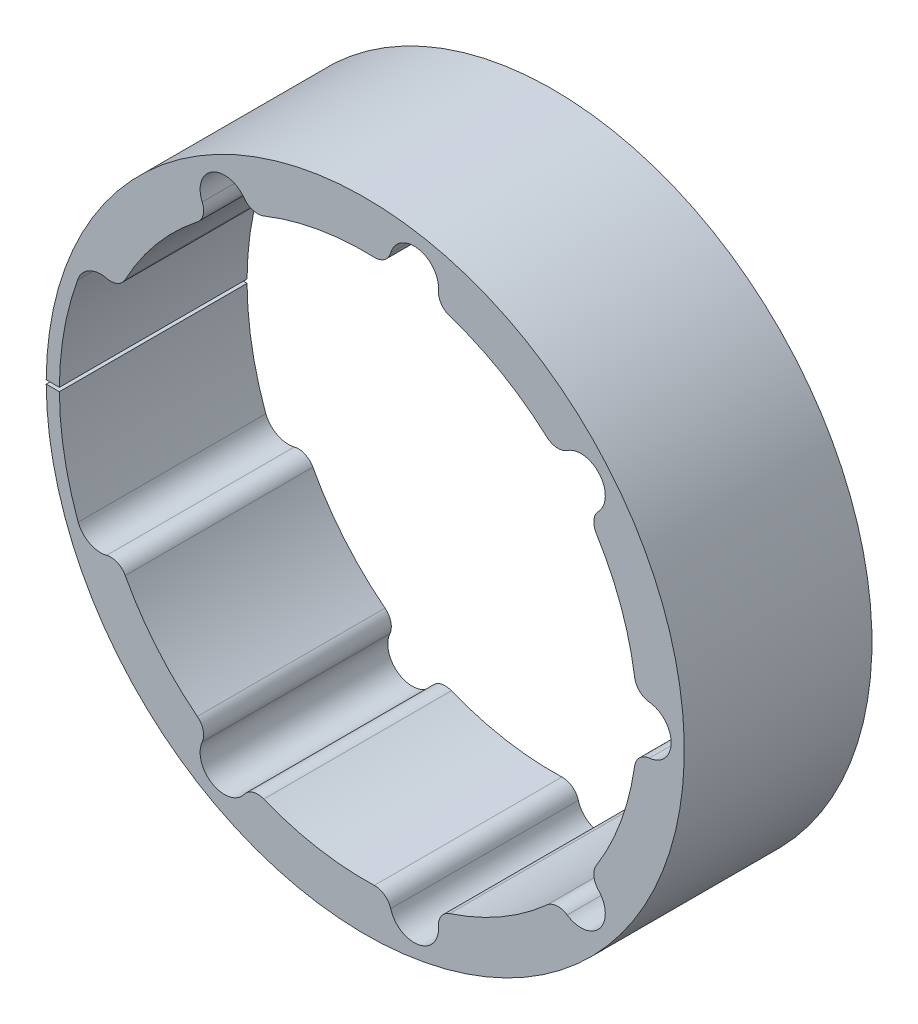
ISO-10303-21;
HEADER;
FILE_DESCRIPTION(('STEP AP214'),'2;1');
FILE_NAME('part.step','',(''),(''),'','','');
FILE_SCHEMA(('AUTOMOTIVE_DESIGN { 1 0 10303 214 1 1 1 1 }'));
ENDSEC;
DATA;
#1=APPLICATION_CONTEXT('core data for automotive mechanical design processes');
#2=APPLICATION_PROTOCOL_DEFINITION('international standard','automotive_design',2000,#1);
#3=PRODUCT_CONTEXT('',#1,'mechanical');
#4=PRODUCT('Part','Part','',(#3));
#5=PRODUCT_RELATED_PRODUCT_CATEGORY('part','',(#4));
#6=PRODUCT_DEFINITION_FORMATION('','',#4);
#7=PRODUCT_DEFINITION_CONTEXT('part definition',#1,'design');
#8=PRODUCT_DEFINITION('design','',#6,#7);
#9=PRODUCT_DEFINITION_SHAPE('','',#8);
#10=(LENGTH_UNIT() NAMED_UNIT(*) SI_UNIT(.MILLI.,.METRE.));
#11=(NAMED_UNIT(*) PLANE_ANGLE_UNIT() SI_UNIT($,.RADIAN.));
#12=(NAMED_UNIT(*) SI_UNIT($,.STERADIAN.) SOLID_ANGLE_UNIT());
#13=UNCERTAINTY_MEASURE_WITH_UNIT(LENGTH_MEASURE(1.E-05),#10,'distance_accuracy_value','');
#14=(GEOMETRIC_REPRESENTATION_CONTEXT(3) GLOBAL_UNCERTAINTY_ASSIGNED_CONTEXT((#13)) GLOBAL_UNIT_ASSIGNED_CONTEXT((#10,
#11,#12)) REPRESENTATION_CONTEXT('',''));
#15=CARTESIAN_POINT('',(0.,0.,0.));
#16=DIRECTION('',(0.,0.,1.));
#17=DIRECTION('',(1.,0.,0.));
#18=AXIS2_PLACEMENT_3D('',#15,#16,#17);
#19=CARTESIAN_POINT('',(0.,0.,25.));
#20=DIRECTION('',(0.,0.,-1.));
#21=DIRECTION('',(-1.,0.,0.));
#22=AXIS2_PLACEMENT_3D('',#19,#20,#21);
#23=CYLINDRICAL_SURFACE('',#22,40.7477238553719);
#24=CARTESIAN_POINT('',(0.,0.,0.));
#25=DIRECTION('',(0.,0.,1.));
#26=DIRECTION('',(1.,0.,0.));
#27=AXIS2_PLACEMENT_3D('',#24,#25,#26);
#28=CIRCLE('',#27,40.7477238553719);
#29=CARTESIAN_POINT('',(-38.3335079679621,13.8173501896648,0.));
#30=VERTEX_POINT('',#29);
#31=CARTESIAN_POINT('',(-40.7469569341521,0.249999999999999,0.));
#32=VERTEX_POINT('',#31);
#33=EDGE_CURVE('E300',#30,#32,#28,.T.);
#34=ORIENTED_EDGE('',*,*,#33,.F.);
#35=DIRECTION('',(0.,0.,-1.));
#36=VECTOR('',#35,1.);
#37=CARTESIAN_POINT('',(-38.3335079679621,13.8173501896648,25.));
#38=LINE('',#37,#36);
#39=CARTESIAN_POINT('',(-38.3335079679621,13.8173501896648,25.));
#40=VERTEX_POINT('',#39);
#41=EDGE_CURVE('E289',#40,#30,#38,.T.);
#42=ORIENTED_EDGE('',*,*,#41,.F.);
#43=CARTESIAN_POINT('',(0.,0.,25.));
#44=DIRECTION('',(0.,0.,1.));
#45=DIRECTION('',(1.,0.,0.));
#46=AXIS2_PLACEMENT_3D('',#43,#44,#45);
#47=CIRCLE('',#46,40.7477238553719);
#48=CARTESIAN_POINT('',(-40.7469569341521,0.249999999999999,25.));
#49=VERTEX_POINT('',#48);
#50=EDGE_CURVE('E295',#40,#49,#47,.T.);
#51=ORIENTED_EDGE('',*,*,#50,.T.);
#52=DIRECTION('',(0.,0.,-1.));
#53=VECTOR('',#52,1.);
#54=CARTESIAN_POINT('',(-40.7469569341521,0.249999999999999,25.));
#55=LINE('',#54,#53);
#56=EDGE_CURVE('E337',#49,#32,#55,.T.);
#57=ORIENTED_EDGE('',*,*,#56,.T.);
#58=EDGE_LOOP('',(#34,#42,#51,#57));
#59=FACE_BOUND('',#58,.T.);
#60=ADVANCED_FACE('F39',(#59),#23,.F.);
#61=CARTESIAN_POINT('',(-35.2384732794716,12.8257553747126,25.));
#62=DIRECTION('',(0.,0.,-1.));
#63=DIRECTION('',(-1.,0.,0.));
#64=AXIS2_PLACEMENT_3D('',#61,#62,#63);
#65=CYLINDRICAL_SURFACE('',#64,3.25000000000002);
#66=CARTESIAN_POINT('',(-35.2384732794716,12.8257553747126,0.));
#67=DIRECTION('',(0.,0.,1.));
#68=DIRECTION('',(1.,0.,0.));
#69=AXIS2_PLACEMENT_3D('',#66,#67,#68);
#70=CIRCLE('',#69,3.25000000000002);
#71=CARTESIAN_POINT('',(-34.4500862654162,15.97868193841,0.));
#72=VERTEX_POINT('',#71);
#73=EDGE_CURVE('E339',#72,#30,#70,.T.);
#74=ORIENTED_EDGE('',*,*,#73,.F.);
#75=DIRECTION('',(0.,0.,-1.));
#76=VECTOR('',#75,1.);
#77=CARTESIAN_POINT('',(-34.4500862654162,15.97868193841,25.));
#78=LINE('',#77,#76);
#79=CARTESIAN_POINT('',(-34.4500862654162,15.97868193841,25.));
#80=VERTEX_POINT('',#79);
#81=EDGE_CURVE('E11',#72,#80,#78,.F.);
#82=ORIENTED_EDGE('',*,*,#81,.T.);
#83=CARTESIAN_POINT('',(-35.2384732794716,12.8257553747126,25.));
#84=DIRECTION('',(0.,0.,1.));
#85=DIRECTION('',(1.,0.,0.));
#86=AXIS2_PLACEMENT_3D('',#83,#84,#85);
#87=CIRCLE('',#86,3.25000000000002);
#88=EDGE_CURVE('E285',#80,#40,#87,.T.);
#89=ORIENTED_EDGE('',*,*,#88,.T.);
#90=ORIENTED_EDGE('',*,*,#41,.T.);
#91=EDGE_LOOP('',(#74,#82,#89,#90));
#92=FACE_BOUND('',#91,.T.);
#93=ADVANCED_FACE('F288',(#92),#65,.F.);
#94=CARTESIAN_POINT('',(0.,0.,25.));
#95=DIRECTION('',(0.,0.,-1.));
#96=DIRECTION('',(-1.,0.,0.));
#97=AXIS2_PLACEMENT_3D('',#94,#95,#96);
#98=CYLINDRICAL_SURFACE('',#97,36.25);
#99=CARTESIAN_POINT('',(0.,0.,0.));
#100=DIRECTION('',(0.,0.,1.));
#101=DIRECTION('',(1.,0.,0.));
#102=AXIS2_PLACEMENT_3D('',#99,#100,#101);
#103=CIRCLE('',#102,36.25);
#104=CARTESIAN_POINT('',(-22.3697067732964,28.5247036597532,0.));
#105=VERTEX_POINT('',#104);
#106=CARTESIAN_POINT('',(-31.9758081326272,17.0765978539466,0.));
#107=VERTEX_POINT('',#106);
#108=EDGE_CURVE('E342',#105,#107,#103,.T.);
#109=ORIENTED_EDGE('',*,*,#108,.F.);
#110=DIRECTION('',(0.,0.,-1.));
#111=VECTOR('',#110,1.);
#112=CARTESIAN_POINT('',(-22.3697067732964,28.5247036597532,25.));
#113=LINE('',#112,#111);
#114=CARTESIAN_POINT('',(-22.3697067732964,28.5247036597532,25.));
#115=VERTEX_POINT('',#114);
#116=EDGE_CURVE('E47',#105,#115,#113,.F.);
#117=ORIENTED_EDGE('',*,*,#116,.T.);
#118=CARTESIAN_POINT('',(0.,0.,25.));
#119=DIRECTION('',(0.,0.,1.));
#120=DIRECTION('',(1.,0.,0.));
#121=AXIS2_PLACEMENT_3D('',#118,#119,#120);
#122=CIRCLE('',#121,36.25);
#123=CARTESIAN_POINT('',(-31.9758081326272,17.0765978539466,25.));
#124=VERTEX_POINT('',#123);
#125=EDGE_CURVE('E294',#115,#124,#122,.T.);
#126=ORIENTED_EDGE('',*,*,#125,.T.);
#127=DIRECTION('',(0.,0.,-1.));
#128=VECTOR('',#127,1.);
#129=CARTESIAN_POINT('',(-31.9758081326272,17.0765978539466,25.));
#130=LINE('',#129,#128);
#131=EDGE_CURVE('E536',#124,#107,#130,.T.);
#132=ORIENTED_EDGE('',*,*,#131,.T.);
#133=EDGE_LOOP('',(#109,#117,#126,#132));
#134=FACE_BOUND('',#133,.T.);
#135=ADVANCED_FACE('F543',(#134),#98,.F.);
#136=CARTESIAN_POINT('',(-18.75,32.4759526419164,25.));
#137=DIRECTION('',(0.,0.,-1.));
#138=DIRECTION('',(-1.,0.,0.));
#139=AXIS2_PLACEMENT_3D('',#136,#137,#138);
#140=CYLINDRICAL_SURFACE('',#139,3.25000000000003);
#141=CARTESIAN_POINT('',(-18.75,32.4759526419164,0.));
#142=DIRECTION('',(0.,0.,1.));
#143=DIRECTION('',(1.,0.,0.));
#144=AXIS2_PLACEMENT_3D('',#141,#142,#143);
#145=CIRCLE('',#144,3.25000000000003);
#146=CARTESIAN_POINT('',(-16.1193983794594,34.3844691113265,0.));
#147=VERTEX_POINT('',#146);
#148=CARTESIAN_POINT('',(-21.7181245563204,31.1520430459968,0.));
#149=VERTEX_POINT('',#148);
#150=EDGE_CURVE('E345',#147,#149,#145,.T.);
#151=ORIENTED_EDGE('',*,*,#150,.F.);
#152=DIRECTION('',(0.,0.,-1.));
#153=VECTOR('',#152,1.);
#154=CARTESIAN_POINT('',(-16.1193983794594,34.3844691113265,25.));
#155=LINE('',#154,#153);
#156=CARTESIAN_POINT('',(-16.1193983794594,34.3844691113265,25.));
#157=VERTEX_POINT('',#156);
#158=EDGE_CURVE('E534',#147,#157,#155,.F.);
#159=ORIENTED_EDGE('',*,*,#158,.T.);
#160=CARTESIAN_POINT('',(-18.75,32.4759526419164,25.));
#161=DIRECTION('',(0.,0.,1.));
#162=DIRECTION('',(1.,0.,0.));
#163=AXIS2_PLACEMENT_3D('',#160,#161,#162);
#164=CIRCLE('',#163,3.25000000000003);
#165=CARTESIAN_POINT('',(-21.7181245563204,31.1520430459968,25.));
#166=VERTEX_POINT('',#165);
#167=EDGE_CURVE('E549',#157,#166,#164,.T.);
#168=ORIENTED_EDGE('',*,*,#167,.T.);
#169=DIRECTION('',(0.,0.,-1.));
#170=VECTOR('',#169,1.);
#171=CARTESIAN_POINT('',(-21.7181245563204,31.1520430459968,25.));
#172=LINE('',#171,#170);
#173=EDGE_CURVE('E531',#166,#149,#172,.T.);
#174=ORIENTED_EDGE('',*,*,#173,.T.);
#175=EDGE_LOOP('',(#151,#159,#168,#174));
#176=FACE_BOUND('',#175,.T.);
#177=ADVANCED_FACE('F555',(#176),#140,.F.);
#178=CARTESIAN_POINT('',(0.,0.,25.));
#179=DIRECTION('',(0.,0.,-1.));
#180=DIRECTION('',(-1.,0.,0.));
#181=AXIS2_PLACEMENT_3D('',#178,#179,#180);
#182=CYLINDRICAL_SURFACE('',#181,36.25);
#183=CARTESIAN_POINT('',(0.,0.,0.));
#184=DIRECTION('',(0.,0.,1.));
#185=DIRECTION('',(1.,0.,0.));
#186=AXIS2_PLACEMENT_3D('',#183,#184,#185);
#187=CIRCLE('',#186,36.25);
#188=CARTESIAN_POINT('',(1.19913651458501,36.2301610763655,0.));
#189=VERTEX_POINT('',#188);
#190=CARTESIAN_POINT('',(-13.5182646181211,33.6350861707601,0.));
#191=VERTEX_POINT('',#190);
#192=EDGE_CURVE('E348',#189,#191,#187,.T.);
#193=ORIENTED_EDGE('',*,*,#192,.F.);
#194=DIRECTION('',(0.,0.,-1.));
#195=VECTOR('',#194,1.);
#196=CARTESIAN_POINT('',(1.19913651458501,36.2301610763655,25.));
#197=LINE('',#196,#195);
#198=CARTESIAN_POINT('',(1.19913651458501,36.2301610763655,25.));
#199=VERTEX_POINT('',#198);
#200=EDGE_CURVE('E529',#189,#199,#197,.F.);
#201=ORIENTED_EDGE('',*,*,#200,.T.);
#202=CARTESIAN_POINT('',(0.,0.,25.));
#203=DIRECTION('',(0.,0.,1.));
#204=DIRECTION('',(1.,0.,0.));
#205=AXIS2_PLACEMENT_3D('',#202,#203,#204);
#206=CIRCLE('',#205,36.25);
#207=CARTESIAN_POINT('',(-13.5182646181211,33.6350861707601,25.));
#208=VERTEX_POINT('',#207);
#209=EDGE_CURVE('E569',#199,#208,#206,.T.);
#210=ORIENTED_EDGE('',*,*,#209,.T.);
#211=DIRECTION('',(0.,0.,-1.));
#212=VECTOR('',#211,1.);
#213=CARTESIAN_POINT('',(-13.5182646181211,33.6350861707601,25.));
#214=LINE('',#213,#212);
#215=EDGE_CURVE('E526',#208,#191,#214,.T.);
#216=ORIENTED_EDGE('',*,*,#215,.T.);
#217=EDGE_LOOP('',(#193,#201,#210,#216));
#218=FACE_BOUND('',#217,.T.);
#219=ADVANCED_FACE('F566',(#218),#182,.F.);
#220=CARTESIAN_POINT('',(6.51180666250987,36.9302907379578,25.));
#221=DIRECTION('',(0.,0.,-1.));
#222=DIRECTION('',(-1.,0.,0.));
#223=AXIS2_PLACEMENT_3D('',#220,#221,#222);
#224=CYLINDRICAL_SURFACE('',#223,3.25000000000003);
#225=CARTESIAN_POINT('',(6.51180666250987,36.9302907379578,0.));
#226=DIRECTION('',(0.,0.,1.));
#227=DIRECTION('',(1.,0.,0.));
#228=AXIS2_PLACEMENT_3D('',#225,#226,#227);
#229=CIRCLE('',#228,3.25000000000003);
#230=CARTESIAN_POINT('',(9.75373515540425,36.7013810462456,0.));
#231=VERTEX_POINT('',#230);
#232=CARTESIAN_POINT('',(3.38709865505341,37.8239908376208,0.));
#233=VERTEX_POINT('',#232);
#234=EDGE_CURVE('E351',#231,#233,#229,.T.);
#235=ORIENTED_EDGE('',*,*,#234,.F.);
#236=DIRECTION('',(0.,0.,-1.));
#237=VECTOR('',#236,1.);
#238=CARTESIAN_POINT('',(9.75373515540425,36.7013810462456,25.));
#239=LINE('',#238,#237);
#240=CARTESIAN_POINT('',(9.75373515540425,36.7013810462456,25.));
#241=VERTEX_POINT('',#240);
#242=EDGE_CURVE('E524',#231,#241,#239,.F.);
#243=ORIENTED_EDGE('',*,*,#242,.T.);
#244=CARTESIAN_POINT('',(6.51180666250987,36.9302907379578,25.));
#245=DIRECTION('',(0.,0.,1.));
#246=DIRECTION('',(1.,0.,0.));
#247=AXIS2_PLACEMENT_3D('',#244,#245,#246);
#248=CIRCLE('',#247,3.25000000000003);
#249=CARTESIAN_POINT('',(3.38709865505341,37.8239908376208,25.));
#250=VERTEX_POINT('',#249);
#251=EDGE_CURVE('E571',#241,#250,#248,.T.);
#252=ORIENTED_EDGE('',*,*,#251,.T.);
#253=DIRECTION('',(0.,0.,-1.));
#254=VECTOR('',#253,1.);
#255=CARTESIAN_POINT('',(3.38709865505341,37.8239908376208,25.));
#256=LINE('',#255,#254);
#257=EDGE_CURVE('E521',#250,#233,#256,.T.);
#258=ORIENTED_EDGE('',*,*,#257,.T.);
#259=EDGE_LOOP('',(#235,#243,#252,#258));
#260=FACE_BOUND('',#259,.T.);
#261=ADVANCED_FACE('F691',(#260),#224,.F.);
#262=CARTESIAN_POINT('',(0.,0.,25.));
#263=DIRECTION('',(0.,0.,-1.));
#264=DIRECTION('',(-1.,0.,0.));
#265=AXIS2_PLACEMENT_3D('',#262,#263,#264);
#266=CYLINDRICAL_SURFACE('',#265,36.25);
#267=CARTESIAN_POINT('',(0.,0.,0.));
#268=DIRECTION('',(0.,0.,1.));
#269=DIRECTION('',(1.,0.,0.));
#270=AXIS2_PLACEMENT_3D('',#267,#268,#269);
#271=CIRCLE('',#270,36.25);
#272=CARTESIAN_POINT('',(24.2068905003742,26.9831234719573,0.));
#273=VERTEX_POINT('',#272);
#274=CARTESIAN_POINT('',(11.2646251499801,34.4553438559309,0.));
#275=VERTEX_POINT('',#274);
#276=EDGE_CURVE('E354',#273,#275,#271,.T.);
#277=ORIENTED_EDGE('',*,*,#276,.F.);
#278=DIRECTION('',(0.,0.,-1.));
#279=VECTOR('',#278,1.);
#280=CARTESIAN_POINT('',(24.2068905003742,26.9831234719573,25.));
#281=LINE('',#280,#279);
#282=CARTESIAN_POINT('',(24.2068905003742,26.9831234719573,25.));
#283=VERTEX_POINT('',#282);
#284=EDGE_CURVE('E519',#273,#283,#281,.F.);
#285=ORIENTED_EDGE('',*,*,#284,.T.);
#286=CARTESIAN_POINT('',(0.,0.,25.));
#287=DIRECTION('',(0.,0.,1.));
#288=DIRECTION('',(1.,0.,0.));
#289=AXIS2_PLACEMENT_3D('',#286,#287,#288);
#290=CIRCLE('',#289,36.25);
#291=CARTESIAN_POINT('',(11.2646251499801,34.4553438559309,25.));
#292=VERTEX_POINT('',#291);
#293=EDGE_CURVE('E574',#283,#292,#290,.T.);
#294=ORIENTED_EDGE('',*,*,#293,.T.);
#295=DIRECTION('',(0.,0.,-1.));
#296=VECTOR('',#295,1.);
#297=CARTESIAN_POINT('',(11.2646251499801,34.4553438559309,25.));
#298=LINE('',#297,#296);
#299=EDGE_CURVE('E516',#292,#275,#298,.T.);
#300=ORIENTED_EDGE('',*,*,#299,.T.);
#301=EDGE_LOOP('',(#277,#285,#294,#300));
#302=FACE_BOUND('',#301,.T.);
#303=ADVANCED_FACE('F682',(#302),#266,.F.);
#304=CARTESIAN_POINT('',(28.7266666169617,24.1045353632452,25.));
#305=DIRECTION('',(0.,0.,-1.));
#306=DIRECTION('',(-1.,0.,0.));
#307=AXIS2_PLACEMENT_3D('',#304,#305,#306);
#308=CYLINDRICAL_SURFACE('',#307,3.25000000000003);
#309=CARTESIAN_POINT('',(28.7266666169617,24.1045353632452,0.));
#310=DIRECTION('',(0.,0.,1.));
#311=DIRECTION('',(1.,0.,0.));
#312=AXIS2_PLACEMENT_3D('',#309,#310,#311);
#313=CIRCLE('',#312,3.25000000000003);
#314=CARTESIAN_POINT('',(31.0629876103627,21.8453088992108,0.));
#315=VERTEX_POINT('',#314);
#316=CARTESIAN_POINT('',(26.9074607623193,26.7976729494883,0.));
#317=VERTEX_POINT('',#316);
#318=EDGE_CURVE('E357',#315,#317,#313,.T.);
#319=ORIENTED_EDGE('',*,*,#318,.F.);
#320=DIRECTION('',(0.,0.,-1.));
#321=VECTOR('',#320,1.);
#322=CARTESIAN_POINT('',(31.0629876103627,21.8453088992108,25.));
#323=LINE('',#322,#321);
#324=CARTESIAN_POINT('',(31.0629876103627,21.8453088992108,25.));
#325=VERTEX_POINT('',#324);
#326=EDGE_CURVE('E514',#315,#325,#323,.F.);
#327=ORIENTED_EDGE('',*,*,#326,.T.);
#328=CARTESIAN_POINT('',(28.7266666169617,24.1045353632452,25.));
#329=DIRECTION('',(0.,0.,1.));
#330=DIRECTION('',(1.,0.,0.));
#331=AXIS2_PLACEMENT_3D('',#328,#329,#330);
#332=CIRCLE('',#331,3.25000000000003);
#333=CARTESIAN_POINT('',(26.9074607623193,26.7976729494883,25.));
#334=VERTEX_POINT('',#333);
#335=EDGE_CURVE('E580',#325,#334,#332,.T.);
#336=ORIENTED_EDGE('',*,*,#335,.T.);
#337=DIRECTION('',(0.,0.,-1.));
#338=VECTOR('',#337,1.);
#339=CARTESIAN_POINT('',(26.9074607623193,26.7976729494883,25.));
#340=LINE('',#339,#338);
#341=EDGE_CURVE('E511',#334,#317,#340,.T.);
#342=ORIENTED_EDGE('',*,*,#341,.T.);
#343=EDGE_LOOP('',(#319,#327,#336,#342));
#344=FACE_BOUND('',#343,.T.);
#345=ADVANCED_FACE('F673',(#344),#308,.F.);
#346=CARTESIAN_POINT('',(0.,0.,25.));
#347=DIRECTION('',(0.,0.,-1.));
#348=DIRECTION('',(-1.,0.,0.));
#349=AXIS2_PLACEMENT_3D('',#346,#347,#348);
#350=CYLINDRICAL_SURFACE('',#349,36.25);
#351=CARTESIAN_POINT('',(0.,0.,0.));
#352=DIRECTION('',(0.,0.,1.));
#353=DIRECTION('',(1.,0.,0.));
#354=AXIS2_PLACEMENT_3D('',#351,#352,#353);
#355=CIRCLE('',#354,36.25);
#356=CARTESIAN_POINT('',(35.8879713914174,5.11038251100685,0.));
#357=VERTEX_POINT('',#356);
#358=CARTESIAN_POINT('',(30.7766716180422,19.1535632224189,0.));
#359=VERTEX_POINT('',#358);
#360=EDGE_CURVE('E360',#357,#359,#355,.T.);
#361=ORIENTED_EDGE('',*,*,#360,.F.);
#362=DIRECTION('',(0.,0.,-1.));
#363=VECTOR('',#362,1.);
#364=CARTESIAN_POINT('',(35.8879713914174,5.11038251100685,25.));
#365=LINE('',#364,#363);
#366=CARTESIAN_POINT('',(35.8879713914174,5.11038251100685,25.));
#367=VERTEX_POINT('',#366);
#368=EDGE_CURVE('E509',#357,#367,#365,.F.);
#369=ORIENTED_EDGE('',*,*,#368,.T.);
#370=CARTESIAN_POINT('',(0.,0.,25.));
#371=DIRECTION('',(0.,0.,1.));
#372=DIRECTION('',(1.,0.,0.));
#373=AXIS2_PLACEMENT_3D('',#370,#371,#372);
#374=CIRCLE('',#373,36.25);
#375=CARTESIAN_POINT('',(30.7766716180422,19.1535632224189,25.));
#376=VERTEX_POINT('',#375);
#377=EDGE_CURVE('E583',#367,#376,#374,.T.);
#378=ORIENTED_EDGE('',*,*,#377,.T.);
#379=DIRECTION('',(0.,0.,-1.));
#380=VECTOR('',#379,1.);
#381=CARTESIAN_POINT('',(30.7766716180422,19.1535632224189,25.));
#382=LINE('',#381,#380);
#383=EDGE_CURVE('E506',#376,#359,#382,.T.);
#384=ORIENTED_EDGE('',*,*,#383,.T.);
#385=EDGE_LOOP('',(#361,#369,#378,#384));
#386=FACE_BOUND('',#385,.T.);
#387=ADVANCED_FACE('F664',(#386),#350,.F.);
#388=CARTESIAN_POINT('',(37.5,0.,25.));
#389=DIRECTION('',(0.,0.,-1.));
#390=DIRECTION('',(-1.,0.,0.));
#391=AXIS2_PLACEMENT_3D('',#388,#389,#390);
#392=CYLINDRICAL_SURFACE('',#391,3.25000000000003);
#393=CARTESIAN_POINT('',(37.5,0.,0.));
#394=DIRECTION('',(0.,0.,1.));
#395=DIRECTION('',(1.,0.,0.));
#396=AXIS2_PLACEMENT_3D('',#393,#394,#395);
#397=CIRCLE('',#396,3.25000000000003);
#398=CARTESIAN_POINT('',(37.8375229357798,-3.23242606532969,0.));
#399=VERTEX_POINT('',#398);
#400=CARTESIAN_POINT('',(37.8375229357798,3.23242606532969,0.));
#401=VERTEX_POINT('',#400);
#402=EDGE_CURVE('E363',#399,#401,#397,.T.);
#403=ORIENTED_EDGE('',*,*,#402,.F.);
#404=DIRECTION('',(0.,0.,-1.));
#405=VECTOR('',#404,1.);
#406=CARTESIAN_POINT('',(37.8375229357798,-3.23242606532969,25.));
#407=LINE('',#406,#405);
#408=CARTESIAN_POINT('',(37.8375229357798,-3.23242606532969,25.));
#409=VERTEX_POINT('',#408);
#410=EDGE_CURVE('E504',#399,#409,#407,.F.);
#411=ORIENTED_EDGE('',*,*,#410,.T.);
#412=CARTESIAN_POINT('',(37.5,0.,25.));
#413=DIRECTION('',(0.,0.,1.));
#414=DIRECTION('',(1.,0.,0.));
#415=AXIS2_PLACEMENT_3D('',#412,#413,#414);
#416=CIRCLE('',#415,3.25000000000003);
#417=CARTESIAN_POINT('',(37.8375229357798,3.23242606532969,25.));
#418=VERTEX_POINT('',#417);
#419=EDGE_CURVE('E586',#409,#418,#416,.T.);
#420=ORIENTED_EDGE('',*,*,#419,.T.);
#421=DIRECTION('',(0.,0.,-1.));
#422=VECTOR('',#421,1.);
#423=CARTESIAN_POINT('',(37.8375229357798,3.23242606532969,25.));
#424=LINE('',#423,#422);
#425=EDGE_CURVE('E501',#418,#401,#424,.T.);
#426=ORIENTED_EDGE('',*,*,#425,.T.);
#427=EDGE_LOOP('',(#403,#411,#420,#426));
#428=FACE_BOUND('',#427,.T.);
#429=ADVANCED_FACE('F655',(#428),#392,.F.);
#430=CARTESIAN_POINT('',(0.,0.,25.));
#431=DIRECTION('',(0.,0.,-1.));
#432=DIRECTION('',(-1.,0.,0.));
#433=AXIS2_PLACEMENT_3D('',#430,#431,#432);
#434=CYLINDRICAL_SURFACE('',#433,36.25);
#435=CARTESIAN_POINT('',(0.,0.,0.));
#436=DIRECTION('',(0.,0.,1.));
#437=DIRECTION('',(1.,0.,0.));
#438=AXIS2_PLACEMENT_3D('',#435,#436,#437);
#439=CIRCLE('',#438,36.25);
#440=CARTESIAN_POINT('',(30.7766716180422,-19.1535632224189,0.));
#441=VERTEX_POINT('',#440);
#442=CARTESIAN_POINT('',(35.8879713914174,-5.11038251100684,0.));
#443=VERTEX_POINT('',#442);
#444=EDGE_CURVE('E366',#441,#443,#439,.T.);
#445=ORIENTED_EDGE('',*,*,#444,.F.);
#446=DIRECTION('',(0.,0.,-1.));
#447=VECTOR('',#446,1.);
#448=CARTESIAN_POINT('',(30.7766716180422,-19.1535632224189,25.));
#449=LINE('',#448,#447);
#450=CARTESIAN_POINT('',(30.7766716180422,-19.1535632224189,25.));
#451=VERTEX_POINT('',#450);
#452=EDGE_CURVE('E499',#441,#451,#449,.F.);
#453=ORIENTED_EDGE('',*,*,#452,.T.);
#454=CARTESIAN_POINT('',(0.,0.,25.));
#455=DIRECTION('',(0.,0.,1.));
#456=DIRECTION('',(1.,0.,0.));
#457=AXIS2_PLACEMENT_3D('',#454,#455,#456);
#458=CIRCLE('',#457,36.25);
#459=CARTESIAN_POINT('',(35.8879713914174,-5.11038251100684,25.));
#460=VERTEX_POINT('',#459);
#461=EDGE_CURVE('E589',#451,#460,#458,.T.);
#462=ORIENTED_EDGE('',*,*,#461,.T.);
#463=DIRECTION('',(0.,0.,-1.));
#464=VECTOR('',#463,1.);
#465=CARTESIAN_POINT('',(35.8879713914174,-5.11038251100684,25.));
#466=LINE('',#465,#464);
#467=EDGE_CURVE('E496',#460,#443,#466,.T.);
#468=ORIENTED_EDGE('',*,*,#467,.T.);
#469=EDGE_LOOP('',(#445,#453,#462,#468));
#470=FACE_BOUND('',#469,.T.);
#471=ADVANCED_FACE('F646',(#470),#434,.F.);
#472=CARTESIAN_POINT('',(28.7266666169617,-24.1045353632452,25.));
#473=DIRECTION('',(0.,0.,-1.));
#474=DIRECTION('',(-1.,0.,0.));
#475=AXIS2_PLACEMENT_3D('',#472,#473,#474);
#476=CYLINDRICAL_SURFACE('',#475,3.25000000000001);
#477=CARTESIAN_POINT('',(28.7266666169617,-24.1045353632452,0.));
#478=DIRECTION('',(0.,0.,1.));
#479=DIRECTION('',(1.,0.,0.));
#480=AXIS2_PLACEMENT_3D('',#477,#478,#479);
#481=CIRCLE('',#480,3.25000000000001);
#482=CARTESIAN_POINT('',(26.9074607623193,-26.7976729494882,0.));
#483=VERTEX_POINT('',#482);
#484=CARTESIAN_POINT('',(31.0629876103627,-21.8453088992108,0.));
#485=VERTEX_POINT('',#484);
#486=EDGE_CURVE('E369',#483,#485,#481,.T.);
#487=ORIENTED_EDGE('',*,*,#486,.F.);
#488=DIRECTION('',(0.,0.,-1.));
#489=VECTOR('',#488,1.);
#490=CARTESIAN_POINT('',(26.9074607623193,-26.7976729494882,25.));
#491=LINE('',#490,#489);
#492=CARTESIAN_POINT('',(26.9074607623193,-26.7976729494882,25.));
#493=VERTEX_POINT('',#492);
#494=EDGE_CURVE('E494',#483,#493,#491,.F.);
#495=ORIENTED_EDGE('',*,*,#494,.T.);
#496=CARTESIAN_POINT('',(28.7266666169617,-24.1045353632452,25.));
#497=DIRECTION('',(0.,0.,1.));
#498=DIRECTION('',(1.,0.,0.));
#499=AXIS2_PLACEMENT_3D('',#496,#497,#498);
#500=CIRCLE('',#499,3.25000000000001);
#501=CARTESIAN_POINT('',(31.0629876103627,-21.8453088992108,25.));
#502=VERTEX_POINT('',#501);
#503=EDGE_CURVE('E592',#493,#502,#500,.T.);
#504=ORIENTED_EDGE('',*,*,#503,.T.);
#505=DIRECTION('',(0.,0.,-1.));
#506=VECTOR('',#505,1.);
#507=CARTESIAN_POINT('',(31.0629876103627,-21.8453088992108,25.));
#508=LINE('',#507,#506);
#509=EDGE_CURVE('E491',#502,#485,#508,.T.);
#510=ORIENTED_EDGE('',*,*,#509,.T.);
#511=EDGE_LOOP('',(#487,#495,#504,#510));
#512=FACE_BOUND('',#511,.T.);
#513=ADVANCED_FACE('F637',(#512),#476,.F.);
#514=CARTESIAN_POINT('',(0.,0.,25.));
#515=DIRECTION('',(0.,0.,-1.));
#516=DIRECTION('',(-1.,0.,0.));
#517=AXIS2_PLACEMENT_3D('',#514,#515,#516);
#518=CYLINDRICAL_SURFACE('',#517,36.25);
#519=CARTESIAN_POINT('',(0.,0.,0.));
#520=DIRECTION('',(0.,0.,1.));
#521=DIRECTION('',(1.,0.,0.));
#522=AXIS2_PLACEMENT_3D('',#519,#520,#521);
#523=CIRCLE('',#522,36.25);
#524=CARTESIAN_POINT('',(11.2646251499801,-34.4553438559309,0.));
#525=VERTEX_POINT('',#524);
#526=CARTESIAN_POINT('',(24.2068905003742,-26.9831234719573,0.));
#527=VERTEX_POINT('',#526);
#528=EDGE_CURVE('E372',#525,#527,#523,.T.);
#529=ORIENTED_EDGE('',*,*,#528,.F.);
#530=DIRECTION('',(0.,0.,-1.));
#531=VECTOR('',#530,1.);
#532=CARTESIAN_POINT('',(11.2646251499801,-34.4553438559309,25.));
#533=LINE('',#532,#531);
#534=CARTESIAN_POINT('',(11.2646251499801,-34.4553438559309,25.));
#535=VERTEX_POINT('',#534);
#536=EDGE_CURVE('E489',#525,#535,#533,.F.);
#537=ORIENTED_EDGE('',*,*,#536,.T.);
#538=CARTESIAN_POINT('',(0.,0.,25.));
#539=DIRECTION('',(0.,0.,1.));
#540=DIRECTION('',(1.,0.,0.));
#541=AXIS2_PLACEMENT_3D('',#538,#539,#540);
#542=CIRCLE('',#541,36.25);
#543=CARTESIAN_POINT('',(24.2068905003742,-26.9831234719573,25.));
#544=VERTEX_POINT('',#543);
#545=EDGE_CURVE('E595',#535,#544,#542,.T.);
#546=ORIENTED_EDGE('',*,*,#545,.T.);
#547=DIRECTION('',(0.,0.,-1.));
#548=VECTOR('',#547,1.);
#549=CARTESIAN_POINT('',(24.2068905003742,-26.9831234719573,25.));
#550=LINE('',#549,#548);
#551=EDGE_CURVE('E486',#544,#527,#550,.T.);
#552=ORIENTED_EDGE('',*,*,#551,.T.);
#553=EDGE_LOOP('',(#529,#537,#546,#552));
#554=FACE_BOUND('',#553,.T.);
#555=ADVANCED_FACE('F628',(#554),#518,.F.);
#556=CARTESIAN_POINT('',(6.51180666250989,-36.9302907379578,25.));
#557=DIRECTION('',(0.,0.,-1.));
#558=DIRECTION('',(-1.,0.,0.));
#559=AXIS2_PLACEMENT_3D('',#556,#557,#558);
#560=CYLINDRICAL_SURFACE('',#559,3.25000000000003);
#561=CARTESIAN_POINT('',(6.51180666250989,-36.9302907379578,0.));
#562=DIRECTION('',(0.,0.,1.));
#563=DIRECTION('',(1.,0.,0.));
#564=AXIS2_PLACEMENT_3D('',#561,#562,#563);
#565=CIRCLE('',#564,3.25000000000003);
#566=CARTESIAN_POINT('',(3.38709865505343,-37.8239908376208,0.));
#567=VERTEX_POINT('',#566);
#568=CARTESIAN_POINT('',(9.75373515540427,-36.7013810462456,0.));
#569=VERTEX_POINT('',#568);
#570=EDGE_CURVE('E375',#567,#569,#565,.T.);
#571=ORIENTED_EDGE('',*,*,#570,.F.);
#572=DIRECTION('',(0.,0.,-1.));
#573=VECTOR('',#572,1.);
#574=CARTESIAN_POINT('',(3.38709865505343,-37.8239908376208,25.));
#575=LINE('',#574,#573);
#576=CARTESIAN_POINT('',(3.38709865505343,-37.8239908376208,25.));
#577=VERTEX_POINT('',#576);
#578=EDGE_CURVE('E484',#567,#577,#575,.F.);
#579=ORIENTED_EDGE('',*,*,#578,.T.);
#580=CARTESIAN_POINT('',(6.51180666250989,-36.9302907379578,25.));
#581=DIRECTION('',(0.,0.,1.));
#582=DIRECTION('',(1.,0.,0.));
#583=AXIS2_PLACEMENT_3D('',#580,#581,#582);
#584=CIRCLE('',#583,3.25000000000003);
#585=CARTESIAN_POINT('',(9.75373515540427,-36.7013810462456,25.));
#586=VERTEX_POINT('',#585);
#587=EDGE_CURVE('E598',#577,#586,#584,.T.);
#588=ORIENTED_EDGE('',*,*,#587,.T.);
#589=DIRECTION('',(0.,0.,-1.));
#590=VECTOR('',#589,1.);
#591=CARTESIAN_POINT('',(9.75373515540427,-36.7013810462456,25.));
#592=LINE('',#591,#590);
#593=EDGE_CURVE('E481',#586,#569,#592,.T.);
#594=ORIENTED_EDGE('',*,*,#593,.T.);
#595=EDGE_LOOP('',(#571,#579,#588,#594));
#596=FACE_BOUND('',#595,.T.);
#597=ADVANCED_FACE('F619',(#596),#560,.F.);
#598=CARTESIAN_POINT('',(0.,0.,25.));
#599=DIRECTION('',(0.,0.,-1.));
#600=DIRECTION('',(-1.,0.,0.));
#601=AXIS2_PLACEMENT_3D('',#598,#599,#600);
#602=CYLINDRICAL_SURFACE('',#601,36.25);
#603=CARTESIAN_POINT('',(0.,0.,0.));
#604=DIRECTION('',(0.,0.,1.));
#605=DIRECTION('',(1.,0.,0.));
#606=AXIS2_PLACEMENT_3D('',#603,#604,#605);
#607=CIRCLE('',#606,36.25);
#608=CARTESIAN_POINT('',(-13.5182646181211,-33.6350861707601,0.));
#609=VERTEX_POINT('',#608);
#610=CARTESIAN_POINT('',(1.19913651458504,-36.2301610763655,0.));
#611=VERTEX_POINT('',#610);
#612=EDGE_CURVE('E378',#609,#611,#607,.T.);
#613=ORIENTED_EDGE('',*,*,#612,.F.);
#614=DIRECTION('',(0.,0.,-1.));
#615=VECTOR('',#614,1.);
#616=CARTESIAN_POINT('',(-13.5182646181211,-33.6350861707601,25.));
#617=LINE('',#616,#615);
#618=CARTESIAN_POINT('',(-13.5182646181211,-33.6350861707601,25.));
#619=VERTEX_POINT('',#618);
#620=EDGE_CURVE('E479',#609,#619,#617,.F.);
#621=ORIENTED_EDGE('',*,*,#620,.T.);
#622=CARTESIAN_POINT('',(0.,0.,25.));
#623=DIRECTION('',(0.,0.,1.));
#624=DIRECTION('',(1.,0.,0.));
#625=AXIS2_PLACEMENT_3D('',#622,#623,#624);
#626=CIRCLE('',#625,36.25);
#627=CARTESIAN_POINT('',(1.19913651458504,-36.2301610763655,25.));
#628=VERTEX_POINT('',#627);
#629=EDGE_CURVE('E601',#619,#628,#626,.T.);
#630=ORIENTED_EDGE('',*,*,#629,.T.);
#631=DIRECTION('',(0.,0.,-1.));
#632=VECTOR('',#631,1.);
#633=CARTESIAN_POINT('',(1.19913651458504,-36.2301610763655,25.));
#634=LINE('',#633,#632);
#635=EDGE_CURVE('E476',#628,#611,#634,.T.);
#636=ORIENTED_EDGE('',*,*,#635,.T.);
#637=EDGE_LOOP('',(#613,#621,#630,#636));
#638=FACE_BOUND('',#637,.T.);
#639=ADVANCED_FACE('F611',(#638),#602,.F.);
#640=CARTESIAN_POINT('',(-18.75,-32.4759526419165,25.));
#641=DIRECTION('',(0.,0.,-1.));
#642=DIRECTION('',(-1.,0.,0.));
#643=AXIS2_PLACEMENT_3D('',#640,#641,#642);
#644=CYLINDRICAL_SURFACE('',#643,3.25000000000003);
#645=CARTESIAN_POINT('',(-18.75,-32.4759526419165,0.));
#646=DIRECTION('',(0.,0.,1.));
#647=DIRECTION('',(1.,0.,0.));
#648=AXIS2_PLACEMENT_3D('',#645,#646,#647);
#649=CIRCLE('',#648,3.25000000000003);
#650=CARTESIAN_POINT('',(-21.7181245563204,-31.1520430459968,0.));
#651=VERTEX_POINT('',#650);
#652=CARTESIAN_POINT('',(-16.1193983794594,-34.3844691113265,0.));
#653=VERTEX_POINT('',#652);
#654=EDGE_CURVE('E381',#651,#653,#649,.T.);
#655=ORIENTED_EDGE('',*,*,#654,.F.);
#656=DIRECTION('',(0.,0.,-1.));
#657=VECTOR('',#656,1.);
#658=CARTESIAN_POINT('',(-21.7181245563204,-31.1520430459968,25.));
#659=LINE('',#658,#657);
#660=CARTESIAN_POINT('',(-21.7181245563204,-31.1520430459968,25.));
#661=VERTEX_POINT('',#660);
#662=EDGE_CURVE('E61',#651,#661,#659,.F.);
#663=ORIENTED_EDGE('',*,*,#662,.T.);
#664=CARTESIAN_POINT('',(-18.75,-32.4759526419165,25.));
#665=DIRECTION('',(0.,0.,1.));
#666=DIRECTION('',(1.,0.,0.));
#667=AXIS2_PLACEMENT_3D('',#664,#665,#666);
#668=CIRCLE('',#667,3.25000000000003);
#669=CARTESIAN_POINT('',(-16.1193983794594,-34.3844691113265,25.));
#670=VERTEX_POINT('',#669);
#671=EDGE_CURVE('E331',#661,#670,#668,.T.);
#672=ORIENTED_EDGE('',*,*,#671,.T.);
#673=DIRECTION('',(0.,0.,-1.));
#674=VECTOR('',#673,1.);
#675=CARTESIAN_POINT('',(-16.1193983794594,-34.3844691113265,25.));
#676=LINE('',#675,#674);
#677=EDGE_CURVE('E472',#670,#653,#676,.T.);
#678=ORIENTED_EDGE('',*,*,#677,.T.);
#679=EDGE_LOOP('',(#655,#663,#672,#678));
#680=FACE_BOUND('',#679,.T.);
#681=ADVANCED_FACE('F604',(#680),#644,.F.);
#682=CARTESIAN_POINT('',(0.,0.,25.));
#683=DIRECTION('',(0.,0.,-1.));
#684=DIRECTION('',(-1.,0.,0.));
#685=AXIS2_PLACEMENT_3D('',#682,#683,#684);
#686=CYLINDRICAL_SURFACE('',#685,36.25);
#687=CARTESIAN_POINT('',(0.,0.,0.));
#688=DIRECTION('',(0.,0.,1.));
#689=DIRECTION('',(1.,0.,0.));
#690=AXIS2_PLACEMENT_3D('',#687,#688,#689);
#691=CIRCLE('',#690,36.25);
#692=CARTESIAN_POINT('',(-31.9758081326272,-17.0765978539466,0.));
#693=VERTEX_POINT('',#692);
#694=CARTESIAN_POINT('',(-22.3697067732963,-28.5247036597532,0.));
#695=VERTEX_POINT('',#694);
#696=EDGE_CURVE('E384',#693,#695,#691,.T.);
#697=ORIENTED_EDGE('',*,*,#696,.F.);
#698=DIRECTION('',(0.,0.,-1.));
#699=VECTOR('',#698,1.);
#700=CARTESIAN_POINT('',(-31.9758081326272,-17.0765978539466,25.));
#701=LINE('',#700,#699);
#702=CARTESIAN_POINT('',(-31.9758081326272,-17.0765978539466,25.));
#703=VERTEX_POINT('',#702);
#704=EDGE_CURVE('E439',#693,#703,#701,.F.);
#705=ORIENTED_EDGE('',*,*,#704,.T.);
#706=CARTESIAN_POINT('',(0.,0.,25.));
#707=DIRECTION('',(0.,0.,1.));
#708=DIRECTION('',(1.,0.,0.));
#709=AXIS2_PLACEMENT_3D('',#706,#707,#708);
#710=CIRCLE('',#709,36.25);
#711=CARTESIAN_POINT('',(-22.3697067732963,-28.5247036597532,25.));
#712=VERTEX_POINT('',#711);
#713=EDGE_CURVE('E324',#703,#712,#710,.T.);
#714=ORIENTED_EDGE('',*,*,#713,.T.);
#715=DIRECTION('',(0.,0.,-1.));
#716=VECTOR('',#715,1.);
#717=CARTESIAN_POINT('',(-22.3697067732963,-28.5247036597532,25.));
#718=LINE('',#717,#716);
#719=EDGE_CURVE('E436',#712,#695,#718,.T.);
#720=ORIENTED_EDGE('',*,*,#719,.T.);
#721=EDGE_LOOP('',(#697,#705,#714,#720));
#722=FACE_BOUND('',#721,.T.);
#723=ADVANCED_FACE('F722',(#722),#686,.F.);
#724=CARTESIAN_POINT('',(-35.2384732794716,-12.8257553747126,25.));
#725=DIRECTION('',(0.,0.,-1.));
#726=DIRECTION('',(-1.,0.,0.));
#727=AXIS2_PLACEMENT_3D('',#724,#725,#726);
#728=CYLINDRICAL_SURFACE('',#727,3.25000000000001);
#729=CARTESIAN_POINT('',(-35.2384732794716,-12.8257553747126,25.));
#730=DIRECTION('',(0.,0.,1.));
#731=DIRECTION('',(1.,0.,0.));
#732=AXIS2_PLACEMENT_3D('',#729,#730,#731);
#733=CIRCLE('',#732,3.25000000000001);
#734=CARTESIAN_POINT('',(-38.2467922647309,-14.0555996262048,25.));
#735=VERTEX_POINT('',#734);
#736=CARTESIAN_POINT('',(-34.4500862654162,-15.97868193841,25.));
#737=VERTEX_POINT('',#736);
#738=EDGE_CURVE('E317',#735,#737,#733,.T.);
#739=ORIENTED_EDGE('',*,*,#738,.T.);
#740=DIRECTION('',(0.,0.,-1.));
#741=VECTOR('',#740,1.);
#742=CARTESIAN_POINT('',(-34.4500862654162,-15.97868193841,25.));
#743=LINE('',#742,#741);
#744=CARTESIAN_POINT('',(-34.4500862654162,-15.97868193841,0.));
#745=VERTEX_POINT('',#744);
#746=EDGE_CURVE('E301',#737,#745,#743,.T.);
#747=ORIENTED_EDGE('',*,*,#746,.T.);
#748=CARTESIAN_POINT('',(-35.2384732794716,-12.8257553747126,0.));
#749=DIRECTION('',(0.,0.,1.));
#750=DIRECTION('',(1.,0.,0.));
#751=AXIS2_PLACEMENT_3D('',#748,#749,#750);
#752=CIRCLE('',#751,3.25000000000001);
#753=CARTESIAN_POINT('',(-38.2467922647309,-14.0555996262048,0.));
#754=VERTEX_POINT('',#753);
#755=EDGE_CURVE('E387',#754,#745,#752,.T.);
#756=ORIENTED_EDGE('',*,*,#755,.F.);
#757=DIRECTION('',(0.,0.,-1.));
#758=VECTOR('',#757,1.);
#759=CARTESIAN_POINT('',(-38.2467922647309,-14.0555996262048,25.));
#760=LINE('',#759,#758);
#761=EDGE_CURVE('E302',#735,#754,#760,.T.);
#762=ORIENTED_EDGE('',*,*,#761,.F.);
#763=EDGE_LOOP('',(#739,#747,#756,#762));
#764=FACE_BOUND('',#763,.T.);
#765=ADVANCED_FACE('F715',(#764),#728,.F.);
#766=CARTESIAN_POINT('',(-40.7469569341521,-0.250000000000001,0.));
#767=VERTEX_POINT('',#766);
#768=EDGE_CURVE('E340',#767,#754,#28,.T.);
#769=ORIENTED_EDGE('',*,*,#768,.F.);
#770=DIRECTION('',(0.,0.,-1.));
#771=VECTOR('',#770,1.);
#772=CARTESIAN_POINT('',(-40.7469569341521,-0.250000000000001,25.));
#773=LINE('',#772,#771);
#774=CARTESIAN_POINT('',(-40.7469569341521,-0.250000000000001,25.));
#775=VERTEX_POINT('',#774);
#776=EDGE_CURVE('E400',#775,#767,#773,.T.);
#777=ORIENTED_EDGE('',*,*,#776,.F.);
#778=EDGE_CURVE('E311',#775,#735,#47,.T.);
#779=ORIENTED_EDGE('',*,*,#778,.T.);
#780=ORIENTED_EDGE('',*,*,#761,.T.);
#781=EDGE_LOOP('',(#769,#777,#779,#780));
#782=FACE_BOUND('',#781,.T.);
#783=ADVANCED_FACE('F706',(#782),#23,.F.);
#784=CARTESIAN_POINT('',(0.,-0.250000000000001,25.));
#785=DIRECTION('',(0.,1.,0.));
#786=DIRECTION('',(0.,0.,1.));
#787=AXIS2_PLACEMENT_3D('',#784,#785,#786);
#788=PLANE('',#787);
#789=DIRECTION('',(1.,0.,0.));
#790=VECTOR('',#789,1.);
#791=CARTESIAN_POINT('',(0.,-0.250000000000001,0.));
#792=LINE('',#791,#790);
#793=CARTESIAN_POINT('',(-42.4992646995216,-0.250000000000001,0.));
#794=VERTEX_POINT('',#793);
#795=EDGE_CURVE('E390',#794,#767,#792,.T.);
#796=ORIENTED_EDGE('',*,*,#795,.F.);
#797=DIRECTION('',(0.,0.,-1.));
#798=VECTOR('',#797,1.);
#799=CARTESIAN_POINT('',(-42.4992646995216,-0.250000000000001,25.));
#800=LINE('',#799,#798);
#801=CARTESIAN_POINT('',(-42.4992646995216,-0.250000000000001,25.));
#802=VERTEX_POINT('',#801);
#803=EDGE_CURVE('E398',#802,#794,#800,.T.);
#804=ORIENTED_EDGE('',*,*,#803,.F.);
#805=DIRECTION('',(1.,0.,0.));
#806=VECTOR('',#805,1.);
#807=CARTESIAN_POINT('',(0.,-0.250000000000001,25.));
#808=LINE('',#807,#806);
#809=EDGE_CURVE('E316',#802,#775,#808,.T.);
#810=ORIENTED_EDGE('',*,*,#809,.T.);
#811=ORIENTED_EDGE('',*,*,#776,.T.);
#812=EDGE_LOOP('',(#796,#804,#810,#811));
#813=FACE_BOUND('',#812,.T.);
#814=ADVANCED_FACE('F714',(#813),#788,.T.);
#815=CARTESIAN_POINT('',(0.,0.,25.));
#816=DIRECTION('',(0.,0.,-1.));
#817=DIRECTION('',(-1.,0.,0.));
#818=AXIS2_PLACEMENT_3D('',#815,#816,#817);
#819=CYLINDRICAL_SURFACE('',#818,42.5);
#820=CARTESIAN_POINT('',(0.,0.,0.));
#821=DIRECTION('',(0.,0.,1.));
#822=DIRECTION('',(1.,0.,0.));
#823=AXIS2_PLACEMENT_3D('',#820,#821,#822);
#824=CIRCLE('',#823,42.5);
#825=CARTESIAN_POINT('',(-42.4992646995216,0.249999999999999,0.));
#826=VERTEX_POINT('',#825);
#827=EDGE_CURVE('E313',#794,#826,#824,.T.);
#828=ORIENTED_EDGE('',*,*,#827,.T.);
#829=DIRECTION('',(0.,0.,-1.));
#830=VECTOR('',#829,1.);
#831=CARTESIAN_POINT('',(-42.4992646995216,0.249999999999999,25.));
#832=LINE('',#831,#830);
#833=CARTESIAN_POINT('',(-42.4992646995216,0.249999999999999,25.));
#834=VERTEX_POINT('',#833);
#835=EDGE_CURVE('E395',#834,#826,#832,.T.);
#836=ORIENTED_EDGE('',*,*,#835,.F.);
#837=CARTESIAN_POINT('',(0.,0.,25.));
#838=DIRECTION('',(0.,0.,1.));
#839=DIRECTION('',(1.,0.,0.));
#840=AXIS2_PLACEMENT_3D('',#837,#838,#839);
#841=CIRCLE('',#840,42.5);
#842=EDGE_CURVE('E321',#802,#834,#841,.T.);
#843=ORIENTED_EDGE('',*,*,#842,.F.);
#844=ORIENTED_EDGE('',*,*,#803,.T.);
#845=EDGE_LOOP('',(#828,#836,#843,#844));
#846=FACE_BOUND('',#845,.T.);
#847=ADVANCED_FACE('F719',(#846),#819,.T.);
#848=CARTESIAN_POINT('',(0.,0.249999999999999,25.));
#849=DIRECTION('',(0.,1.,0.));
#850=DIRECTION('',(0.,0.,1.));
#851=AXIS2_PLACEMENT_3D('',#848,#849,#850);
#852=PLANE('',#851);
#853=DIRECTION('',(1.,0.,0.));
#854=VECTOR('',#853,1.);
#855=CARTESIAN_POINT('',(0.,0.249999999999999,0.));
#856=LINE('',#855,#854);
#857=EDGE_CURVE('E309',#826,#32,#856,.T.);
#858=ORIENTED_EDGE('',*,*,#857,.T.);
#859=ORIENTED_EDGE('',*,*,#56,.F.);
#860=DIRECTION('',(1.,0.,0.));
#861=VECTOR('',#860,1.);
#862=CARTESIAN_POINT('',(0.,0.249999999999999,25.));
#863=LINE('',#862,#861);
#864=EDGE_CURVE('E307',#834,#49,#863,.T.);
#865=ORIENTED_EDGE('',*,*,#864,.F.);
#866=ORIENTED_EDGE('',*,*,#835,.T.);
#867=EDGE_LOOP('',(#858,#859,#865,#866));
#868=FACE_BOUND('',#867,.T.);
#869=ADVANCED_FACE('F804',(#868),#852,.F.);
#870=CARTESIAN_POINT('',(0.,0.,25.));
#871=DIRECTION('',(0.,0.,1.));
#872=DIRECTION('',(1.,0.,0.));
#873=AXIS2_PLACEMENT_3D('',#870,#871,#872);
#874=PLANE('',#873);
#875=ORIENTED_EDGE('',*,*,#713,.F.);
#876=CARTESIAN_POINT('',(-33.9164089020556,-18.1129706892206,25.));
#877=DIRECTION('',(0.,0.,1.));
#878=DIRECTION('',(1.,0.,0.));
#879=AXIS2_PLACEMENT_3D('',#876,#877,#878);
#880=CIRCLE('',#879,2.2);
#881=EDGE_CURVE('E470',#703,#737,#880,.T.);
#882=ORIENTED_EDGE('',*,*,#881,.T.);
#883=ORIENTED_EDGE('',*,*,#738,.F.);
#884=ORIENTED_EDGE('',*,*,#778,.F.);
#885=ORIENTED_EDGE('',*,*,#809,.F.);
#886=ORIENTED_EDGE('',*,*,#842,.T.);
#887=ORIENTED_EDGE('',*,*,#864,.T.);
#888=ORIENTED_EDGE('',*,*,#50,.F.);
#889=ORIENTED_EDGE('',*,*,#88,.F.);
#890=CARTESIAN_POINT('',(-33.9164089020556,18.1129706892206,25.));
#891=DIRECTION('',(0.,0.,1.));
#892=DIRECTION('',(1.,0.,0.));
#893=AXIS2_PLACEMENT_3D('',#890,#891,#892);
#894=CIRCLE('',#893,2.2);
#895=EDGE_CURVE('E441',#80,#124,#894,.T.);
#896=ORIENTED_EDGE('',*,*,#895,.T.);
#897=ORIENTED_EDGE('',*,*,#125,.F.);
#898=CARTESIAN_POINT('',(-23.7273165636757,30.2558580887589,25.));
#899=DIRECTION('',(0.,0.,1.));
#900=DIRECTION('',(1.,0.,0.));
#901=AXIS2_PLACEMENT_3D('',#898,#899,#900);
#902=CIRCLE('',#901,2.2);
#903=EDGE_CURVE('E443',#115,#166,#902,.T.);
#904=ORIENTED_EDGE('',*,*,#903,.T.);
#905=ORIENTED_EDGE('',*,*,#167,.F.);
#906=CARTESIAN_POINT('',(-14.3386834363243,35.6763879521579,25.));
#907=DIRECTION('',(0.,0.,1.));
#908=DIRECTION('',(1.,0.,0.));
#909=AXIS2_PLACEMENT_3D('',#906,#907,#908);
#910=CIRCLE('',#909,2.2);
#911=EDGE_CURVE('E445',#157,#208,#910,.T.);
#912=ORIENTED_EDGE('',*,*,#911,.T.);
#913=ORIENTED_EDGE('',*,*,#209,.F.);
#914=CARTESIAN_POINT('',(1.27191169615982,38.4289570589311,25.));
#915=DIRECTION('',(0.,0.,1.));
#916=DIRECTION('',(1.,0.,0.));
#917=AXIS2_PLACEMENT_3D('',#914,#915,#916);
#918=CIRCLE('',#917,2.2);
#919=EDGE_CURVE('E447',#199,#250,#918,.T.);
#920=ORIENTED_EDGE('',*,*,#919,.T.);
#921=ORIENTED_EDGE('',*,*,#251,.F.);
#922=CARTESIAN_POINT('',(11.9482713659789,36.5464267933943,25.));
#923=DIRECTION('',(0.,0.,1.));
#924=DIRECTION('',(1.,0.,0.));
#925=AXIS2_PLACEMENT_3D('',#922,#923,#924);
#926=CIRCLE('',#925,2.2);
#927=EDGE_CURVE('E449',#241,#292,#926,.T.);
#928=ORIENTED_EDGE('',*,*,#927,.T.);
#929=ORIENTED_EDGE('',*,*,#293,.F.);
#930=CARTESIAN_POINT('',(25.6759983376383,28.6207199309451,25.));
#931=DIRECTION('',(0.,0.,1.));
#932=DIRECTION('',(1.,0.,0.));
#933=AXIS2_PLACEMENT_3D('',#930,#931,#932);
#934=CIRCLE('',#933,2.2);
#935=EDGE_CURVE('E451',#283,#334,#934,.T.);
#936=ORIENTED_EDGE('',*,*,#935,.T.);
#937=ORIENTED_EDGE('',*,*,#335,.F.);
#938=CARTESIAN_POINT('',(32.6444972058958,20.3159863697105,25.));
#939=DIRECTION('',(0.,0.,1.));
#940=DIRECTION('',(1.,0.,0.));
#941=AXIS2_PLACEMENT_3D('',#938,#939,#940);
#942=CIRCLE('',#941,2.2);
#943=EDGE_CURVE('E453',#325,#376,#942,.T.);
#944=ORIENTED_EDGE('',*,*,#943,.T.);
#945=ORIENTED_EDGE('',*,*,#377,.F.);
#946=CARTESIAN_POINT('',(38.066,5.42052986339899,25.));
#947=DIRECTION('',(0.,0.,1.));
#948=DIRECTION('',(1.,0.,0.));
#949=AXIS2_PLACEMENT_3D('',#946,#947,#948);
#950=CIRCLE('',#949,2.2);
#951=EDGE_CURVE('E455',#367,#418,#950,.T.);
#952=ORIENTED_EDGE('',*,*,#951,.T.);
#953=ORIENTED_EDGE('',*,*,#419,.F.);
#954=CARTESIAN_POINT('',(38.066,-5.42052986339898,25.));
#955=DIRECTION('',(0.,0.,1.));
#956=DIRECTION('',(1.,0.,0.));
#957=AXIS2_PLACEMENT_3D('',#954,#955,#956);
#958=CIRCLE('',#957,2.2);
#959=EDGE_CURVE('E457',#409,#460,#958,.T.);
#960=ORIENTED_EDGE('',*,*,#959,.T.);
#961=ORIENTED_EDGE('',*,*,#461,.F.);
#962=CARTESIAN_POINT('',(32.6444972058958,-20.3159863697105,25.));
#963=DIRECTION('',(0.,0.,1.));
#964=DIRECTION('',(1.,0.,0.));
#965=AXIS2_PLACEMENT_3D('',#962,#963,#964);
#966=CIRCLE('',#965,2.2);
#967=EDGE_CURVE('E459',#451,#502,#966,.T.);
#968=ORIENTED_EDGE('',*,*,#967,.T.);
#969=ORIENTED_EDGE('',*,*,#503,.F.);
#970=CARTESIAN_POINT('',(25.6759983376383,-28.6207199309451,25.));
#971=DIRECTION('',(0.,0.,1.));
#972=DIRECTION('',(1.,0.,0.));
#973=AXIS2_PLACEMENT_3D('',#970,#971,#972);
#974=CIRCLE('',#973,2.2);
#975=EDGE_CURVE('E461',#493,#544,#974,.T.);
#976=ORIENTED_EDGE('',*,*,#975,.T.);
#977=ORIENTED_EDGE('',*,*,#545,.F.);
#978=CARTESIAN_POINT('',(11.9482713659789,-36.5464267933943,25.));
#979=DIRECTION('',(0.,0.,1.));
#980=DIRECTION('',(1.,0.,0.));
#981=AXIS2_PLACEMENT_3D('',#978,#979,#980);
#982=CIRCLE('',#981,2.2);
#983=EDGE_CURVE('E463',#535,#586,#982,.T.);
#984=ORIENTED_EDGE('',*,*,#983,.T.);
#985=ORIENTED_EDGE('',*,*,#587,.F.);
#986=CARTESIAN_POINT('',(1.27191169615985,-38.4289570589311,25.));
#987=DIRECTION('',(0.,0.,1.));
#988=DIRECTION('',(1.,0.,0.));
#989=AXIS2_PLACEMENT_3D('',#986,#987,#988);
#990=CIRCLE('',#989,2.2);
#991=EDGE_CURVE('E465',#577,#628,#990,.T.);
#992=ORIENTED_EDGE('',*,*,#991,.T.);
#993=ORIENTED_EDGE('',*,*,#629,.F.);
#994=CARTESIAN_POINT('',(-14.3386834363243,-35.6763879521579,25.));
#995=DIRECTION('',(0.,0.,1.));
#996=DIRECTION('',(1.,0.,0.));
#997=AXIS2_PLACEMENT_3D('',#994,#995,#996);
#998=CIRCLE('',#997,2.2);
#999=EDGE_CURVE('E54',#619,#670,#998,.T.);
#1000=ORIENTED_EDGE('',*,*,#999,.T.);
#1001=ORIENTED_EDGE('',*,*,#671,.F.);
#1002=CARTESIAN_POINT('',(-23.7273165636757,-30.255858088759,25.));
#1003=DIRECTION('',(0.,0.,1.));
#1004=DIRECTION('',(1.,0.,0.));
#1005=AXIS2_PLACEMENT_3D('',#1002,#1003,#1004);
#1006=CIRCLE('',#1005,2.2);
#1007=EDGE_CURVE('E468',#661,#712,#1006,.T.);
#1008=ORIENTED_EDGE('',*,*,#1007,.T.);
#1009=EDGE_LOOP('',(#875,#882,#883,#884,#885,#886,#887,#888,#889,#896,#897,#904,#905,#912,#913,
#920,#921,#928,#929,#936,#937,#944,#945,#952,#953,#960,#961,#968,#969,#976,#977,#984,#985,#992,
#993,#1000,#1001,#1008));
#1010=FACE_BOUND('',#1009,.T.);
#1011=ADVANCED_FACE('F305',(#1010),#874,.T.);
#1012=CARTESIAN_POINT('',(0.,0.,0.));
#1013=DIRECTION('',(0.,0.,1.));
#1014=DIRECTION('',(1.,0.,0.));
#1015=AXIS2_PLACEMENT_3D('',#1012,#1013,#1014);
#1016=PLANE('',#1015);
#1017=ORIENTED_EDGE('',*,*,#755,.T.);
#1018=CARTESIAN_POINT('',(-33.9164089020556,-18.1129706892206,0.));
#1019=DIRECTION('',(0.,0.,1.));
#1020=DIRECTION('',(1.,0.,0.));
#1021=AXIS2_PLACEMENT_3D('',#1018,#1019,#1020);
#1022=CIRCLE('',#1021,2.2);
#1023=EDGE_CURVE('E434',#745,#693,#1022,.F.);
#1024=ORIENTED_EDGE('',*,*,#1023,.T.);
#1025=ORIENTED_EDGE('',*,*,#696,.T.);
#1026=CARTESIAN_POINT('',(-23.7273165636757,-30.255858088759,0.));
#1027=DIRECTION('',(0.,0.,1.));
#1028=DIRECTION('',(1.,0.,0.));
#1029=AXIS2_PLACEMENT_3D('',#1026,#1027,#1028);
#1030=CIRCLE('',#1029,2.2);
#1031=EDGE_CURVE('E432',#695,#651,#1030,.F.);
#1032=ORIENTED_EDGE('',*,*,#1031,.T.);
#1033=ORIENTED_EDGE('',*,*,#654,.T.);
#1034=CARTESIAN_POINT('',(-14.3386834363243,-35.6763879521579,0.));
#1035=DIRECTION('',(0.,0.,1.));
#1036=DIRECTION('',(1.,0.,0.));
#1037=AXIS2_PLACEMENT_3D('',#1034,#1035,#1036);
#1038=CIRCLE('',#1037,2.2);
#1039=EDGE_CURVE('E430',#653,#609,#1038,.F.);
#1040=ORIENTED_EDGE('',*,*,#1039,.T.);
#1041=ORIENTED_EDGE('',*,*,#612,.T.);
#1042=CARTESIAN_POINT('',(1.27191169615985,-38.4289570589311,0.));
#1043=DIRECTION('',(0.,0.,1.));
#1044=DIRECTION('',(1.,0.,0.));
#1045=AXIS2_PLACEMENT_3D('',#1042,#1043,#1044);
#1046=CIRCLE('',#1045,2.2);
#1047=EDGE_CURVE('E428',#611,#567,#1046,.F.);
#1048=ORIENTED_EDGE('',*,*,#1047,.T.);
#1049=ORIENTED_EDGE('',*,*,#570,.T.);
#1050=CARTESIAN_POINT('',(11.9482713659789,-36.5464267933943,0.));
#1051=DIRECTION('',(0.,0.,1.));
#1052=DIRECTION('',(1.,0.,0.));
#1053=AXIS2_PLACEMENT_3D('',#1050,#1051,#1052);
#1054=CIRCLE('',#1053,2.2);
#1055=EDGE_CURVE('E426',#569,#525,#1054,.F.);
#1056=ORIENTED_EDGE('',*,*,#1055,.T.);
#1057=ORIENTED_EDGE('',*,*,#528,.T.);
#1058=CARTESIAN_POINT('',(25.6759983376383,-28.6207199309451,0.));
#1059=DIRECTION('',(0.,0.,1.));
#1060=DIRECTION('',(1.,0.,0.));
#1061=AXIS2_PLACEMENT_3D('',#1058,#1059,#1060);
#1062=CIRCLE('',#1061,2.2);
#1063=EDGE_CURVE('E424',#527,#483,#1062,.F.);
#1064=ORIENTED_EDGE('',*,*,#1063,.T.);
#1065=ORIENTED_EDGE('',*,*,#486,.T.);
#1066=CARTESIAN_POINT('',(32.6444972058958,-20.3159863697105,0.));
#1067=DIRECTION('',(0.,0.,1.));
#1068=DIRECTION('',(1.,0.,0.));
#1069=AXIS2_PLACEMENT_3D('',#1066,#1067,#1068);
#1070=CIRCLE('',#1069,2.2);
#1071=EDGE_CURVE('E422',#485,#441,#1070,.F.);
#1072=ORIENTED_EDGE('',*,*,#1071,.T.);
#1073=ORIENTED_EDGE('',*,*,#444,.T.);
#1074=CARTESIAN_POINT('',(38.066,-5.42052986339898,0.));
#1075=DIRECTION('',(0.,0.,1.));
#1076=DIRECTION('',(1.,0.,0.));
#1077=AXIS2_PLACEMENT_3D('',#1074,#1075,#1076);
#1078=CIRCLE('',#1077,2.2);
#1079=EDGE_CURVE('E420',#443,#399,#1078,.F.);
#1080=ORIENTED_EDGE('',*,*,#1079,.T.);
#1081=ORIENTED_EDGE('',*,*,#402,.T.);
#1082=CARTESIAN_POINT('',(38.066,5.42052986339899,0.));
#1083=DIRECTION('',(0.,0.,1.));
#1084=DIRECTION('',(1.,0.,0.));
#1085=AXIS2_PLACEMENT_3D('',#1082,#1083,#1084);
#1086=CIRCLE('',#1085,2.2);
#1087=EDGE_CURVE('E418',#401,#357,#1086,.F.);
#1088=ORIENTED_EDGE('',*,*,#1087,.T.);
#1089=ORIENTED_EDGE('',*,*,#360,.T.);
#1090=CARTESIAN_POINT('',(32.6444972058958,20.3159863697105,0.));
#1091=DIRECTION('',(0.,0.,1.));
#1092=DIRECTION('',(1.,0.,0.));
#1093=AXIS2_PLACEMENT_3D('',#1090,#1091,#1092);
#1094=CIRCLE('',#1093,2.2);
#1095=EDGE_CURVE('E416',#359,#315,#1094,.F.);
#1096=ORIENTED_EDGE('',*,*,#1095,.T.);
#1097=ORIENTED_EDGE('',*,*,#318,.T.);
#1098=CARTESIAN_POINT('',(25.6759983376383,28.6207199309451,0.));
#1099=DIRECTION('',(0.,0.,1.));
#1100=DIRECTION('',(1.,0.,0.));
#1101=AXIS2_PLACEMENT_3D('',#1098,#1099,#1100);
#1102=CIRCLE('',#1101,2.2);
#1103=EDGE_CURVE('E414',#317,#273,#1102,.F.);
#1104=ORIENTED_EDGE('',*,*,#1103,.T.);
#1105=ORIENTED_EDGE('',*,*,#276,.T.);
#1106=CARTESIAN_POINT('',(11.9482713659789,36.5464267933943,0.));
#1107=DIRECTION('',(0.,0.,1.));
#1108=DIRECTION('',(1.,0.,0.));
#1109=AXIS2_PLACEMENT_3D('',#1106,#1107,#1108);
#1110=CIRCLE('',#1109,2.2);
#1111=EDGE_CURVE('E412',#275,#231,#1110,.F.);
#1112=ORIENTED_EDGE('',*,*,#1111,.T.);
#1113=ORIENTED_EDGE('',*,*,#234,.T.);
#1114=CARTESIAN_POINT('',(1.27191169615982,38.4289570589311,0.));
#1115=DIRECTION('',(0.,0.,1.));
#1116=DIRECTION('',(1.,0.,0.));
#1117=AXIS2_PLACEMENT_3D('',#1114,#1115,#1116);
#1118=CIRCLE('',#1117,2.2);
#1119=EDGE_CURVE('E410',#233,#189,#1118,.F.);
#1120=ORIENTED_EDGE('',*,*,#1119,.T.);
#1121=ORIENTED_EDGE('',*,*,#192,.T.);
#1122=CARTESIAN_POINT('',(-14.3386834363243,35.6763879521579,0.));
#1123=DIRECTION('',(0.,0.,1.));
#1124=DIRECTION('',(1.,0.,0.));
#1125=AXIS2_PLACEMENT_3D('',#1122,#1123,#1124);
#1126=CIRCLE('',#1125,2.2);
#1127=EDGE_CURVE('E408',#191,#147,#1126,.F.);
#1128=ORIENTED_EDGE('',*,*,#1127,.T.);
#1129=ORIENTED_EDGE('',*,*,#150,.T.);
#1130=CARTESIAN_POINT('',(-23.7273165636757,30.2558580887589,0.));
#1131=DIRECTION('',(0.,0.,1.));
#1132=DIRECTION('',(1.,0.,0.));
#1133=AXIS2_PLACEMENT_3D('',#1130,#1131,#1132);
#1134=CIRCLE('',#1133,2.2);
#1135=EDGE_CURVE('E406',#149,#105,#1134,.F.);
#1136=ORIENTED_EDGE('',*,*,#1135,.T.);
#1137=ORIENTED_EDGE('',*,*,#108,.T.);
#1138=CARTESIAN_POINT('',(-33.9164089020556,18.1129706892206,0.));
#1139=DIRECTION('',(0.,0.,1.));
#1140=DIRECTION('',(1.,0.,0.));
#1141=AXIS2_PLACEMENT_3D('',#1138,#1139,#1140);
#1142=CIRCLE('',#1141,2.2);
#1143=EDGE_CURVE('E404',#107,#72,#1142,.F.);
#1144=ORIENTED_EDGE('',*,*,#1143,.T.);
#1145=ORIENTED_EDGE('',*,*,#73,.T.);
#1146=ORIENTED_EDGE('',*,*,#33,.T.);
#1147=ORIENTED_EDGE('',*,*,#857,.F.);
#1148=ORIENTED_EDGE('',*,*,#827,.F.);
#1149=ORIENTED_EDGE('',*,*,#795,.T.);
#1150=ORIENTED_EDGE('',*,*,#768,.T.);
#1151=EDGE_LOOP('',(#1017,#1024,#1025,#1032,#1033,#1040,#1041,#1048,#1049,#1056,#1057,#1064,
#1065,#1072,#1073,#1080,#1081,#1088,#1089,#1096,#1097,#1104,#1105,#1112,#1113,#1120,#1121,#1128,
#1129,#1136,#1137,#1144,#1145,#1146,#1147,#1148,#1149,#1150));
#1152=FACE_BOUND('',#1151,.T.);
#1153=ADVANCED_FACE('F558',(#1152),#1016,.F.);
#1154=CARTESIAN_POINT('',(-33.9164089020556,-18.1129706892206,25.));
#1155=DIRECTION('',(0.,0.,-1.));
#1156=DIRECTION('',(-1.,0.,0.));
#1157=AXIS2_PLACEMENT_3D('',#1154,#1155,#1156);
#1158=CYLINDRICAL_SURFACE('',#1157,2.2);
#1159=ORIENTED_EDGE('',*,*,#881,.F.);
#1160=ORIENTED_EDGE('',*,*,#704,.F.);
#1161=ORIENTED_EDGE('',*,*,#1023,.F.);
#1162=ORIENTED_EDGE('',*,*,#746,.F.);
#1163=EDGE_LOOP('',(#1159,#1160,#1161,#1162));
#1164=FACE_BOUND('',#1163,.T.);
#1165=ADVANCED_FACE('F735',(#1164),#1158,.T.);
#1166=CARTESIAN_POINT('',(-23.7273165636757,-30.255858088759,25.));
#1167=DIRECTION('',(0.,0.,-1.));
#1168=DIRECTION('',(-1.,0.,0.));
#1169=AXIS2_PLACEMENT_3D('',#1166,#1167,#1168);
#1170=CYLINDRICAL_SURFACE('',#1169,2.2);
#1171=ORIENTED_EDGE('',*,*,#1007,.F.);
#1172=ORIENTED_EDGE('',*,*,#662,.F.);
#1173=ORIENTED_EDGE('',*,*,#1031,.F.);
#1174=ORIENTED_EDGE('',*,*,#719,.F.);
#1175=EDGE_LOOP('',(#1171,#1172,#1173,#1174));
#1176=FACE_BOUND('',#1175,.T.);
#1177=ADVANCED_FACE('F740',(#1176),#1170,.T.);
#1178=CARTESIAN_POINT('',(-14.3386834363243,-35.6763879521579,25.));
#1179=DIRECTION('',(0.,0.,-1.));
#1180=DIRECTION('',(-1.,0.,0.));
#1181=AXIS2_PLACEMENT_3D('',#1178,#1179,#1180);
#1182=CYLINDRICAL_SURFACE('',#1181,2.2);
#1183=ORIENTED_EDGE('',*,*,#999,.F.);
#1184=ORIENTED_EDGE('',*,*,#620,.F.);
#1185=ORIENTED_EDGE('',*,*,#1039,.F.);
#1186=ORIENTED_EDGE('',*,*,#677,.F.);
#1187=EDGE_LOOP('',(#1183,#1184,#1185,#1186));
#1188=FACE_BOUND('',#1187,.T.);
#1189=ADVANCED_FACE('F607',(#1188),#1182,.T.);
#1190=CARTESIAN_POINT('',(1.27191169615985,-38.4289570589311,25.));
#1191=DIRECTION('',(0.,0.,-1.));
#1192=DIRECTION('',(-1.,0.,0.));
#1193=AXIS2_PLACEMENT_3D('',#1190,#1191,#1192);
#1194=CYLINDRICAL_SURFACE('',#1193,2.2);
#1195=ORIENTED_EDGE('',*,*,#991,.F.);
#1196=ORIENTED_EDGE('',*,*,#578,.F.);
#1197=ORIENTED_EDGE('',*,*,#1047,.F.);
#1198=ORIENTED_EDGE('',*,*,#635,.F.);
#1199=EDGE_LOOP('',(#1195,#1196,#1197,#1198));
#1200=FACE_BOUND('',#1199,.T.);
#1201=ADVANCED_FACE('F615',(#1200),#1194,.T.);
#1202=CARTESIAN_POINT('',(11.9482713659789,-36.5464267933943,25.));
#1203=DIRECTION('',(0.,0.,-1.));
#1204=DIRECTION('',(-1.,0.,0.));
#1205=AXIS2_PLACEMENT_3D('',#1202,#1203,#1204);
#1206=CYLINDRICAL_SURFACE('',#1205,2.2);
#1207=ORIENTED_EDGE('',*,*,#983,.F.);
#1208=ORIENTED_EDGE('',*,*,#536,.F.);
#1209=ORIENTED_EDGE('',*,*,#1055,.F.);
#1210=ORIENTED_EDGE('',*,*,#593,.F.);
#1211=EDGE_LOOP('',(#1207,#1208,#1209,#1210));
#1212=FACE_BOUND('',#1211,.T.);
#1213=ADVANCED_FACE('F624',(#1212),#1206,.T.);
#1214=CARTESIAN_POINT('',(25.6759983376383,-28.6207199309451,25.));
#1215=DIRECTION('',(0.,0.,-1.));
#1216=DIRECTION('',(-1.,0.,0.));
#1217=AXIS2_PLACEMENT_3D('',#1214,#1215,#1216);
#1218=CYLINDRICAL_SURFACE('',#1217,2.2);
#1219=ORIENTED_EDGE('',*,*,#975,.F.);
#1220=ORIENTED_EDGE('',*,*,#494,.F.);
#1221=ORIENTED_EDGE('',*,*,#1063,.F.);
#1222=ORIENTED_EDGE('',*,*,#551,.F.);
#1223=EDGE_LOOP('',(#1219,#1220,#1221,#1222));
#1224=FACE_BOUND('',#1223,.T.);
#1225=ADVANCED_FACE('F633',(#1224),#1218,.T.);
#1226=CARTESIAN_POINT('',(32.6444972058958,-20.3159863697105,25.));
#1227=DIRECTION('',(0.,0.,-1.));
#1228=DIRECTION('',(-1.,0.,0.));
#1229=AXIS2_PLACEMENT_3D('',#1226,#1227,#1228);
#1230=CYLINDRICAL_SURFACE('',#1229,2.2);
#1231=ORIENTED_EDGE('',*,*,#967,.F.);
#1232=ORIENTED_EDGE('',*,*,#452,.F.);
#1233=ORIENTED_EDGE('',*,*,#1071,.F.);
#1234=ORIENTED_EDGE('',*,*,#509,.F.);
#1235=EDGE_LOOP('',(#1231,#1232,#1233,#1234));
#1236=FACE_BOUND('',#1235,.T.);
#1237=ADVANCED_FACE('F642',(#1236),#1230,.T.);
#1238=CARTESIAN_POINT('',(38.066,-5.42052986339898,25.));
#1239=DIRECTION('',(0.,0.,-1.));
#1240=DIRECTION('',(-1.,0.,0.));
#1241=AXIS2_PLACEMENT_3D('',#1238,#1239,#1240);
#1242=CYLINDRICAL_SURFACE('',#1241,2.2);
#1243=ORIENTED_EDGE('',*,*,#959,.F.);
#1244=ORIENTED_EDGE('',*,*,#410,.F.);
#1245=ORIENTED_EDGE('',*,*,#1079,.F.);
#1246=ORIENTED_EDGE('',*,*,#467,.F.);
#1247=EDGE_LOOP('',(#1243,#1244,#1245,#1246));
#1248=FACE_BOUND('',#1247,.T.);
#1249=ADVANCED_FACE('F651',(#1248),#1242,.T.);
#1250=CARTESIAN_POINT('',(38.066,5.42052986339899,25.));
#1251=DIRECTION('',(0.,0.,-1.));
#1252=DIRECTION('',(-1.,0.,0.));
#1253=AXIS2_PLACEMENT_3D('',#1250,#1251,#1252);
#1254=CYLINDRICAL_SURFACE('',#1253,2.2);
#1255=ORIENTED_EDGE('',*,*,#951,.F.);
#1256=ORIENTED_EDGE('',*,*,#368,.F.);
#1257=ORIENTED_EDGE('',*,*,#1087,.F.);
#1258=ORIENTED_EDGE('',*,*,#425,.F.);
#1259=EDGE_LOOP('',(#1255,#1256,#1257,#1258));
#1260=FACE_BOUND('',#1259,.T.);
#1261=ADVANCED_FACE('F660',(#1260),#1254,.T.);
#1262=CARTESIAN_POINT('',(32.6444972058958,20.3159863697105,25.));
#1263=DIRECTION('',(0.,0.,-1.));
#1264=DIRECTION('',(-1.,0.,0.));
#1265=AXIS2_PLACEMENT_3D('',#1262,#1263,#1264);
#1266=CYLINDRICAL_SURFACE('',#1265,2.2);
#1267=ORIENTED_EDGE('',*,*,#943,.F.);
#1268=ORIENTED_EDGE('',*,*,#326,.F.);
#1269=ORIENTED_EDGE('',*,*,#1095,.F.);
#1270=ORIENTED_EDGE('',*,*,#383,.F.);
#1271=EDGE_LOOP('',(#1267,#1268,#1269,#1270));
#1272=FACE_BOUND('',#1271,.T.);
#1273=ADVANCED_FACE('F669',(#1272),#1266,.T.);
#1274=CARTESIAN_POINT('',(25.6759983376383,28.6207199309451,25.));
#1275=DIRECTION('',(0.,0.,-1.));
#1276=DIRECTION('',(-1.,0.,0.));
#1277=AXIS2_PLACEMENT_3D('',#1274,#1275,#1276);
#1278=CYLINDRICAL_SURFACE('',#1277,2.2);
#1279=ORIENTED_EDGE('',*,*,#935,.F.);
#1280=ORIENTED_EDGE('',*,*,#284,.F.);
#1281=ORIENTED_EDGE('',*,*,#1103,.F.);
#1282=ORIENTED_EDGE('',*,*,#341,.F.);
#1283=EDGE_LOOP('',(#1279,#1280,#1281,#1282));
#1284=FACE_BOUND('',#1283,.T.);
#1285=ADVANCED_FACE('F678',(#1284),#1278,.T.);
#1286=CARTESIAN_POINT('',(11.9482713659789,36.5464267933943,25.));
#1287=DIRECTION('',(0.,0.,-1.));
#1288=DIRECTION('',(-1.,0.,0.));
#1289=AXIS2_PLACEMENT_3D('',#1286,#1287,#1288);
#1290=CYLINDRICAL_SURFACE('',#1289,2.2);
#1291=ORIENTED_EDGE('',*,*,#927,.F.);
#1292=ORIENTED_EDGE('',*,*,#242,.F.);
#1293=ORIENTED_EDGE('',*,*,#1111,.F.);
#1294=ORIENTED_EDGE('',*,*,#299,.F.);
#1295=EDGE_LOOP('',(#1291,#1292,#1293,#1294));
#1296=FACE_BOUND('',#1295,.T.);
#1297=ADVANCED_FACE('F687',(#1296),#1290,.T.);
#1298=CARTESIAN_POINT('',(1.27191169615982,38.4289570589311,25.));
#1299=DIRECTION('',(0.,0.,-1.));
#1300=DIRECTION('',(-1.,0.,0.));
#1301=AXIS2_PLACEMENT_3D('',#1298,#1299,#1300);
#1302=CYLINDRICAL_SURFACE('',#1301,2.2);
#1303=ORIENTED_EDGE('',*,*,#919,.F.);
#1304=ORIENTED_EDGE('',*,*,#200,.F.);
#1305=ORIENTED_EDGE('',*,*,#1119,.F.);
#1306=ORIENTED_EDGE('',*,*,#257,.F.);
#1307=EDGE_LOOP('',(#1303,#1304,#1305,#1306));
#1308=FACE_BOUND('',#1307,.T.);
#1309=ADVANCED_FACE('F695',(#1308),#1302,.T.);
#1310=CARTESIAN_POINT('',(-14.3386834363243,35.6763879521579,25.));
#1311=DIRECTION('',(0.,0.,-1.));
#1312=DIRECTION('',(-1.,0.,0.));
#1313=AXIS2_PLACEMENT_3D('',#1310,#1311,#1312);
#1314=CYLINDRICAL_SURFACE('',#1313,2.2);
#1315=ORIENTED_EDGE('',*,*,#911,.F.);
#1316=ORIENTED_EDGE('',*,*,#158,.F.);
#1317=ORIENTED_EDGE('',*,*,#1127,.F.);
#1318=ORIENTED_EDGE('',*,*,#215,.F.);
#1319=EDGE_LOOP('',(#1315,#1316,#1317,#1318));
#1320=FACE_BOUND('',#1319,.T.);
#1321=ADVANCED_FACE('F563',(#1320),#1314,.T.);
#1322=CARTESIAN_POINT('',(-23.7273165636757,30.2558580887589,25.));
#1323=DIRECTION('',(0.,0.,-1.));
#1324=DIRECTION('',(-1.,0.,0.));
#1325=AXIS2_PLACEMENT_3D('',#1322,#1323,#1324);
#1326=CYLINDRICAL_SURFACE('',#1325,2.2);
#1327=ORIENTED_EDGE('',*,*,#903,.F.);
#1328=ORIENTED_EDGE('',*,*,#116,.F.);
#1329=ORIENTED_EDGE('',*,*,#1135,.F.);
#1330=ORIENTED_EDGE('',*,*,#173,.F.);
#1331=EDGE_LOOP('',(#1327,#1328,#1329,#1330));
#1332=FACE_BOUND('',#1331,.T.);
#1333=ADVANCED_FACE('F552',(#1332),#1326,.T.);
#1334=CARTESIAN_POINT('',(-33.9164089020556,18.1129706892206,25.));
#1335=DIRECTION('',(0.,0.,-1.));
#1336=DIRECTION('',(-1.,0.,0.));
#1337=AXIS2_PLACEMENT_3D('',#1334,#1335,#1336);
#1338=CYLINDRICAL_SURFACE('',#1337,2.2);
#1339=ORIENTED_EDGE('',*,*,#895,.F.);
#1340=ORIENTED_EDGE('',*,*,#81,.F.);
#1341=ORIENTED_EDGE('',*,*,#1143,.F.);
#1342=ORIENTED_EDGE('',*,*,#131,.F.);
#1343=EDGE_LOOP('',(#1339,#1340,#1341,#1342));
#1344=FACE_BOUND('',#1343,.T.);
#1345=ADVANCED_FACE('F41',(#1344),#1338,.T.);
#1346=CLOSED_SHELL('',(#60,#93,#135,#177,#219,#261,#303,#345,#387,#429,#471,#513,#555,#597,#639,
#681,#723,#765,#783,#814,#847,#869,#1011,#1153,#1165,#1177,#1189,#1201,#1213,#1225,#1237,#1249,
#1261,#1273,#1285,#1297,#1309,#1321,#1333,#1345));
#1347=MANIFOLD_SOLID_BREP('B2',#1346);
#1348=ADVANCED_BREP_SHAPE_REPRESENTATION('',(#18,#1347),#14);
#1349=SHAPE_DEFINITION_REPRESENTATION(#9,#1348);
ENDSEC;
END-ISO-10303-21;
